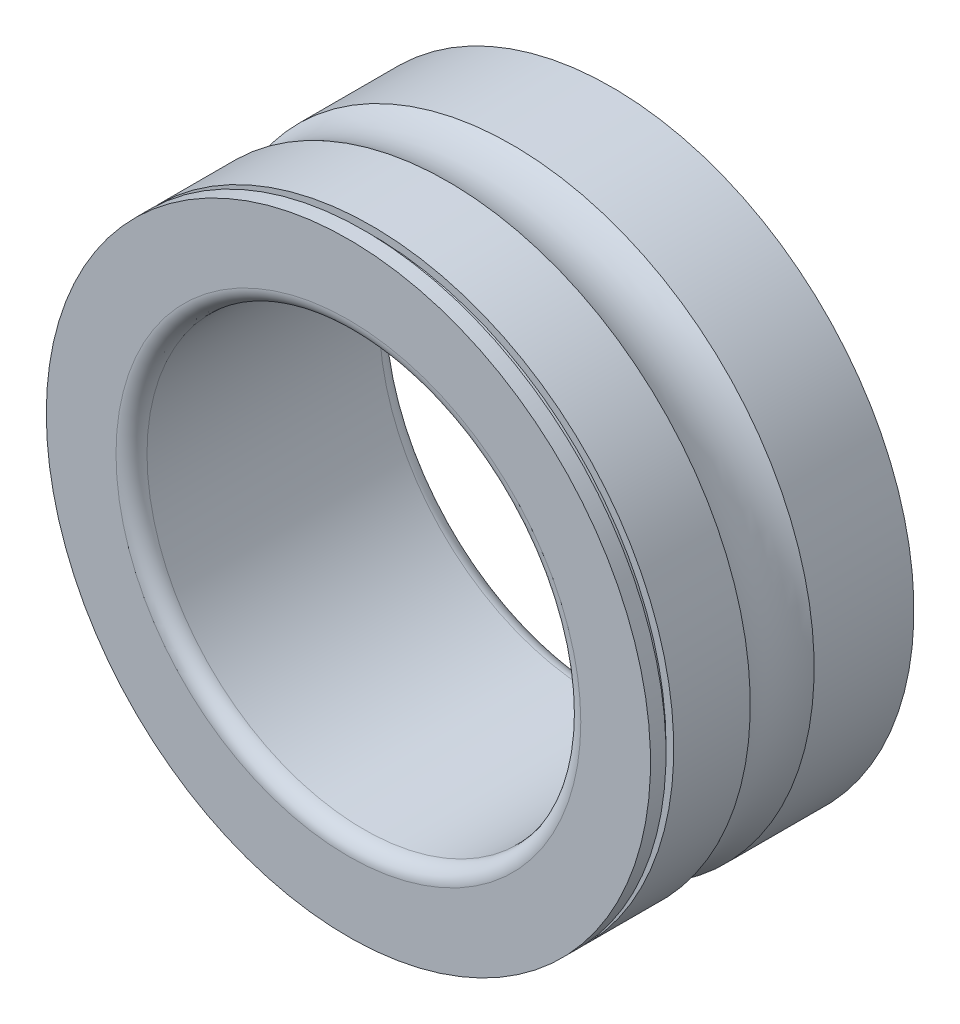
ISO-10303-21;
HEADER;
FILE_DESCRIPTION(('STEP AP214'),'2;1');
FILE_NAME('part.step','',(''),(''),'','','');
FILE_SCHEMA(('AUTOMOTIVE_DESIGN { 1 0 10303 214 1 1 1 1 }'));
ENDSEC;
DATA;
#1=APPLICATION_CONTEXT('core data for automotive mechanical design processes');
#2=APPLICATION_PROTOCOL_DEFINITION('international standard','automotive_design',2000,#1);
#3=PRODUCT_CONTEXT('',#1,'mechanical');
#4=PRODUCT('Part','Part','',(#3));
#5=PRODUCT_RELATED_PRODUCT_CATEGORY('part','',(#4));
#6=PRODUCT_DEFINITION_FORMATION('','',#4);
#7=PRODUCT_DEFINITION_CONTEXT('part definition',#1,'design');
#8=PRODUCT_DEFINITION('design','',#6,#7);
#9=PRODUCT_DEFINITION_SHAPE('','',#8);
#10=(LENGTH_UNIT() NAMED_UNIT(*) SI_UNIT(.MILLI.,.METRE.));
#11=(NAMED_UNIT(*) PLANE_ANGLE_UNIT() SI_UNIT($,.RADIAN.));
#12=(NAMED_UNIT(*) SI_UNIT($,.STERADIAN.) SOLID_ANGLE_UNIT());
#13=UNCERTAINTY_MEASURE_WITH_UNIT(LENGTH_MEASURE(1.E-05),#10,'distance_accuracy_value','');
#14=(GEOMETRIC_REPRESENTATION_CONTEXT(3) GLOBAL_UNCERTAINTY_ASSIGNED_CONTEXT((#13)) GLOBAL_UNIT_ASSIGNED_CONTEXT((#10,
#11,#12)) REPRESENTATION_CONTEXT('',''));
#15=CARTESIAN_POINT('',(0.,0.,0.));
#16=DIRECTION('',(0.,0.,1.));
#17=DIRECTION('',(1.,0.,0.));
#18=AXIS2_PLACEMENT_3D('',#15,#16,#17);
#19=CARTESIAN_POINT('',(0.,0.,-3.75));
#20=DIRECTION('',(0.,0.,-1.));
#21=DIRECTION('',(-1.,0.,0.));
#22=AXIS2_PLACEMENT_3D('',#19,#20,#21);
#23=TOROIDAL_SURFACE('',#22,7.5,0.499999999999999);
#24=CARTESIAN_POINT('',(0.,0.,-3.75));
#25=DIRECTION('',(0.,0.,-1.));
#26=DIRECTION('',(-1.,0.,0.));
#27=AXIS2_PLACEMENT_3D('',#24,#25,#26);
#28=CIRCLE('',#27,7.);
#29=CARTESIAN_POINT('',(-7.,0.,-3.75));
#30=VERTEX_POINT('',#29);
#31=EDGE_CURVE('E10',#30,#30,#28,.T.);
#32=ORIENTED_EDGE('',*,*,#31,.F.);
#33=EDGE_LOOP('',(#32));
#34=FACE_BOUND('',#33,.T.);
#35=CARTESIAN_POINT('',(0.,0.,-4.25));
#36=DIRECTION('',(0.,0.,-1.));
#37=DIRECTION('',(-1.,0.,0.));
#38=AXIS2_PLACEMENT_3D('',#35,#36,#37);
#39=CIRCLE('',#38,7.5);
#40=CARTESIAN_POINT('',(-7.5,0.,-4.25));
#41=VERTEX_POINT('',#40);
#42=EDGE_CURVE('E70',#41,#41,#39,.T.);
#43=ORIENTED_EDGE('',*,*,#42,.T.);
#44=EDGE_LOOP('',(#43));
#45=FACE_BOUND('',#44,.T.);
#46=ADVANCED_FACE('F30',(#34,#45),#23,.T.);
#47=CARTESIAN_POINT('',(0.,0.,0.));
#48=DIRECTION('',(0.,0.,-1.));
#49=DIRECTION('',(-1.,0.,0.));
#50=AXIS2_PLACEMENT_3D('',#47,#48,#49);
#51=CYLINDRICAL_SURFACE('',#50,7.);
#52=CARTESIAN_POINT('',(0.,0.,3.75));
#53=DIRECTION('',(0.,0.,-1.));
#54=DIRECTION('',(-1.,0.,0.));
#55=AXIS2_PLACEMENT_3D('',#52,#53,#54);
#56=CIRCLE('',#55,7.);
#57=CARTESIAN_POINT('',(-7.,0.,3.75));
#58=VERTEX_POINT('',#57);
#59=EDGE_CURVE('E36',#58,#58,#56,.T.);
#60=ORIENTED_EDGE('',*,*,#59,.F.);
#61=EDGE_LOOP('',(#60));
#62=FACE_BOUND('',#61,.T.);
#63=ORIENTED_EDGE('',*,*,#31,.T.);
#64=EDGE_LOOP('',(#63));
#65=FACE_BOUND('',#64,.T.);
#66=ADVANCED_FACE('F87',(#62,#65),#51,.F.);
#67=CARTESIAN_POINT('',(0.,0.,3.75));
#68=DIRECTION('',(0.,0.,-1.));
#69=DIRECTION('',(-1.,0.,0.));
#70=AXIS2_PLACEMENT_3D('',#67,#68,#69);
#71=TOROIDAL_SURFACE('',#70,7.5,0.500000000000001);
#72=ORIENTED_EDGE('',*,*,#59,.T.);
#73=EDGE_LOOP('',(#72));
#74=FACE_BOUND('',#73,.T.);
#75=CARTESIAN_POINT('',(0.,0.,4.25));
#76=DIRECTION('',(0.,0.,-1.));
#77=DIRECTION('',(-1.,0.,0.));
#78=AXIS2_PLACEMENT_3D('',#75,#76,#77);
#79=CIRCLE('',#78,7.5);
#80=CARTESIAN_POINT('',(-7.5,0.,4.25));
#81=VERTEX_POINT('',#80);
#82=EDGE_CURVE('E40',#81,#81,#79,.T.);
#83=ORIENTED_EDGE('',*,*,#82,.F.);
#84=EDGE_LOOP('',(#83));
#85=FACE_BOUND('',#84,.T.);
#86=ADVANCED_FACE('F92',(#74,#85),#71,.T.);
#87=CARTESIAN_POINT('',(0.,9.75,4.25));
#88=DIRECTION('',(0.,0.,1.));
#89=DIRECTION('',(1.,0.,0.));
#90=AXIS2_PLACEMENT_3D('',#87,#88,#89);
#91=PLANE('',#90);
#92=ORIENTED_EDGE('',*,*,#82,.T.);
#93=EDGE_LOOP('',(#92));
#94=FACE_BOUND('',#93,.T.);
#95=CARTESIAN_POINT('',(0.,0.,4.25));
#96=DIRECTION('',(0.,0.,-1.));
#97=DIRECTION('',(-1.,0.,0.));
#98=AXIS2_PLACEMENT_3D('',#95,#96,#97);
#99=CIRCLE('',#98,9.75);
#100=CARTESIAN_POINT('',(-9.75,0.,4.25));
#101=VERTEX_POINT('',#100);
#102=EDGE_CURVE('E44',#101,#101,#99,.T.);
#103=ORIENTED_EDGE('',*,*,#102,.F.);
#104=EDGE_LOOP('',(#103));
#105=FACE_BOUND('',#104,.T.);
#106=ADVANCED_FACE('F97',(#94,#105),#91,.T.);
#107=CARTESIAN_POINT('',(0.,0.,0.));
#108=DIRECTION('',(0.,0.,-1.));
#109=DIRECTION('',(-1.,0.,0.));
#110=AXIS2_PLACEMENT_3D('',#107,#108,#109);
#111=CYLINDRICAL_SURFACE('',#110,9.75);
#112=CARTESIAN_POINT('',(0.,0.,3.75));
#113=DIRECTION('',(0.,0.,-1.));
#114=DIRECTION('',(-1.,0.,0.));
#115=AXIS2_PLACEMENT_3D('',#112,#113,#114);
#116=CIRCLE('',#115,9.75);
#117=CARTESIAN_POINT('',(-9.75,0.,3.75));
#118=VERTEX_POINT('',#117);
#119=EDGE_CURVE('E49',#118,#118,#116,.T.);
#120=ORIENTED_EDGE('',*,*,#119,.F.);
#121=EDGE_LOOP('',(#120));
#122=FACE_BOUND('',#121,.T.);
#123=ORIENTED_EDGE('',*,*,#102,.T.);
#124=EDGE_LOOP('',(#123));
#125=FACE_BOUND('',#124,.T.);
#126=ADVANCED_FACE('F102',(#122,#125),#111,.T.);
#127=CARTESIAN_POINT('',(0.,9.75,3.75));
#128=DIRECTION('',(0.,0.,1.));
#129=DIRECTION('',(1.,0.,0.));
#130=AXIS2_PLACEMENT_3D('',#127,#128,#129);
#131=PLANE('',#130);
#132=CARTESIAN_POINT('',(0.,0.,3.75));
#133=DIRECTION('',(0.,0.,-1.));
#134=DIRECTION('',(-1.,0.,0.));
#135=AXIS2_PLACEMENT_3D('',#132,#133,#134);
#136=CIRCLE('',#135,9.5);
#137=CARTESIAN_POINT('',(-9.5,0.,3.75));
#138=VERTEX_POINT('',#137);
#139=EDGE_CURVE('E52',#138,#138,#136,.T.);
#140=ORIENTED_EDGE('',*,*,#139,.F.);
#141=EDGE_LOOP('',(#140));
#142=FACE_BOUND('',#141,.T.);
#143=ORIENTED_EDGE('',*,*,#119,.T.);
#144=EDGE_LOOP('',(#143));
#145=FACE_BOUND('',#144,.T.);
#146=ADVANCED_FACE('F106',(#142,#145),#131,.F.);
#147=CARTESIAN_POINT('',(0.,0.,0.));
#148=DIRECTION('',(0.,0.,-1.));
#149=DIRECTION('',(-1.,0.,0.));
#150=AXIS2_PLACEMENT_3D('',#147,#148,#149);
#151=CYLINDRICAL_SURFACE('',#150,9.5);
#152=CARTESIAN_POINT('',(0.,0.,3.5));
#153=DIRECTION('',(0.,0.,-1.));
#154=DIRECTION('',(-1.,0.,0.));
#155=AXIS2_PLACEMENT_3D('',#152,#153,#154);
#156=CIRCLE('',#155,9.5);
#157=CARTESIAN_POINT('',(-9.5,0.,3.5));
#158=VERTEX_POINT('',#157);
#159=EDGE_CURVE('E55',#158,#158,#156,.T.);
#160=ORIENTED_EDGE('',*,*,#159,.F.);
#161=EDGE_LOOP('',(#160));
#162=FACE_BOUND('',#161,.T.);
#163=ORIENTED_EDGE('',*,*,#139,.T.);
#164=EDGE_LOOP('',(#163));
#165=FACE_BOUND('',#164,.T.);
#166=ADVANCED_FACE('F110',(#162,#165),#151,.T.);
#167=CARTESIAN_POINT('',(0.,9.5,3.5));
#168=DIRECTION('',(0.,0.,-1.));
#169=DIRECTION('',(-1.,0.,0.));
#170=AXIS2_PLACEMENT_3D('',#167,#168,#169);
#171=PLANE('',#170);
#172=CARTESIAN_POINT('',(0.,0.,3.5));
#173=DIRECTION('',(0.,0.,-1.));
#174=DIRECTION('',(-1.,0.,0.));
#175=AXIS2_PLACEMENT_3D('',#172,#173,#174);
#176=CIRCLE('',#175,9.75);
#177=CARTESIAN_POINT('',(-9.75,0.,3.5));
#178=VERTEX_POINT('',#177);
#179=EDGE_CURVE('E58',#178,#178,#176,.T.);
#180=ORIENTED_EDGE('',*,*,#179,.F.);
#181=EDGE_LOOP('',(#180));
#182=FACE_BOUND('',#181,.T.);
#183=ORIENTED_EDGE('',*,*,#159,.T.);
#184=EDGE_LOOP('',(#183));
#185=FACE_BOUND('',#184,.T.);
#186=ADVANCED_FACE('F114',(#182,#185),#171,.F.);
#187=CARTESIAN_POINT('',(0.,0.,0.));
#188=DIRECTION('',(0.,0.,-1.));
#189=DIRECTION('',(-1.,0.,0.));
#190=AXIS2_PLACEMENT_3D('',#187,#188,#189);
#191=CYLINDRICAL_SURFACE('',#190,9.75);
#192=CARTESIAN_POINT('',(0.,0.,1.03077640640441));
#193=DIRECTION('',(0.,0.,-1.));
#194=DIRECTION('',(-1.,0.,0.));
#195=AXIS2_PLACEMENT_3D('',#192,#193,#194);
#196=CIRCLE('',#195,9.75);
#197=CARTESIAN_POINT('',(-9.75,0.,1.03077640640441));
#198=VERTEX_POINT('',#197);
#199=EDGE_CURVE('E61',#198,#198,#196,.T.);
#200=ORIENTED_EDGE('',*,*,#199,.F.);
#201=EDGE_LOOP('',(#200));
#202=FACE_BOUND('',#201,.T.);
#203=ORIENTED_EDGE('',*,*,#179,.T.);
#204=EDGE_LOOP('',(#203));
#205=FACE_BOUND('',#204,.T.);
#206=ADVANCED_FACE('F118',(#202,#205),#191,.T.);
#207=CARTESIAN_POINT('',(0.,0.,0.));
#208=DIRECTION('',(0.,0.,-1.));
#209=DIRECTION('',(-1.,0.,0.));
#210=AXIS2_PLACEMENT_3D('',#207,#208,#209);
#211=TOROIDAL_SURFACE('',#210,11.75,2.25);
#212=CARTESIAN_POINT('',(0.,0.,-1.03077640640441));
#213=DIRECTION('',(0.,0.,-1.));
#214=DIRECTION('',(-1.,0.,0.));
#215=AXIS2_PLACEMENT_3D('',#212,#213,#214);
#216=CIRCLE('',#215,9.75);
#217=CARTESIAN_POINT('',(-9.75,0.,-1.03077640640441));
#218=VERTEX_POINT('',#217);
#219=EDGE_CURVE('E64',#218,#218,#216,.T.);
#220=ORIENTED_EDGE('',*,*,#219,.F.);
#221=EDGE_LOOP('',(#220));
#222=FACE_BOUND('',#221,.T.);
#223=ORIENTED_EDGE('',*,*,#199,.T.);
#224=EDGE_LOOP('',(#223));
#225=FACE_BOUND('',#224,.T.);
#226=ADVANCED_FACE('F83',(#222,#225),#211,.F.);
#227=CARTESIAN_POINT('',(0.,0.,0.));
#228=DIRECTION('',(0.,0.,-1.));
#229=DIRECTION('',(-1.,0.,0.));
#230=AXIS2_PLACEMENT_3D('',#227,#228,#229);
#231=CYLINDRICAL_SURFACE('',#230,9.75);
#232=CARTESIAN_POINT('',(0.,0.,-4.25));
#233=DIRECTION('',(0.,0.,-1.));
#234=DIRECTION('',(-1.,0.,0.));
#235=AXIS2_PLACEMENT_3D('',#232,#233,#234);
#236=CIRCLE('',#235,9.75);
#237=CARTESIAN_POINT('',(-9.75,0.,-4.25));
#238=VERTEX_POINT('',#237);
#239=EDGE_CURVE('E67',#238,#238,#236,.T.);
#240=ORIENTED_EDGE('',*,*,#239,.F.);
#241=EDGE_LOOP('',(#240));
#242=FACE_BOUND('',#241,.T.);
#243=ORIENTED_EDGE('',*,*,#219,.T.);
#244=EDGE_LOOP('',(#243));
#245=FACE_BOUND('',#244,.T.);
#246=ADVANCED_FACE('F77',(#242,#245),#231,.T.);
#247=CARTESIAN_POINT('',(0.,7.5,-4.25));
#248=DIRECTION('',(0.,0.,-1.));
#249=DIRECTION('',(-1.,0.,0.));
#250=AXIS2_PLACEMENT_3D('',#247,#248,#249);
#251=PLANE('',#250);
#252=ORIENTED_EDGE('',*,*,#239,.T.);
#253=EDGE_LOOP('',(#252));
#254=FACE_BOUND('',#253,.T.);
#255=ORIENTED_EDGE('',*,*,#42,.F.);
#256=EDGE_LOOP('',(#255));
#257=FACE_BOUND('',#256,.T.);
#258=ADVANCED_FACE('F75',(#254,#257),#251,.T.);
#259=CLOSED_SHELL('',(#46,#66,#86,#106,#126,#146,#166,#186,#206,#226,#246,#258));
#260=MANIFOLD_SOLID_BREP('B2',#259);
#261=ADVANCED_BREP_SHAPE_REPRESENTATION('',(#18,#260),#14);
#262=SHAPE_DEFINITION_REPRESENTATION(#9,#261);
ENDSEC;
END-ISO-10303-21;
